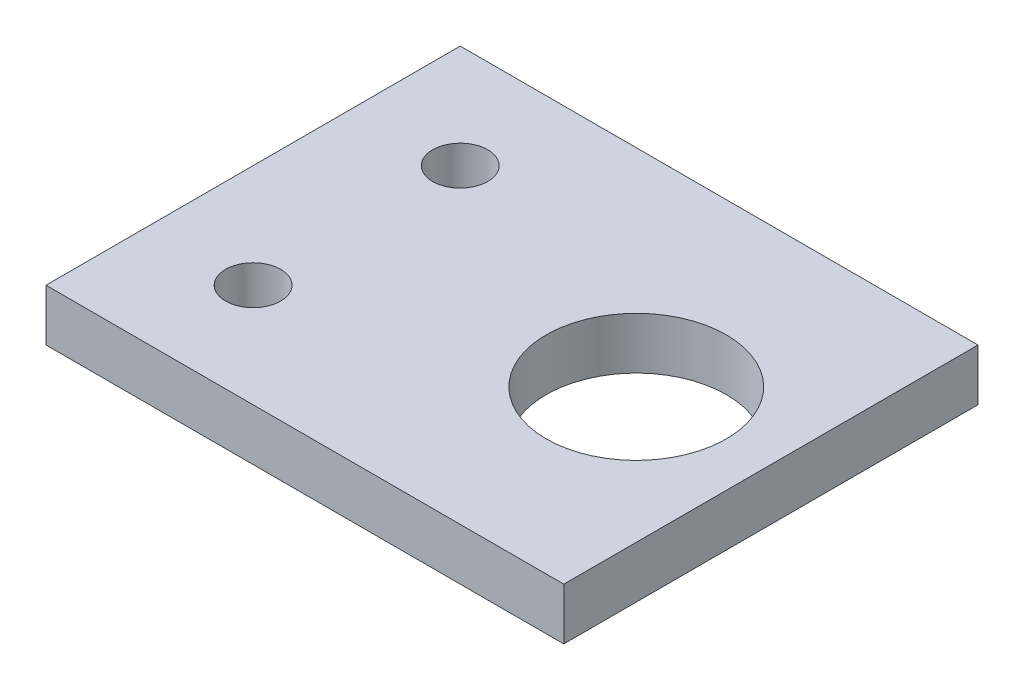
from build123d import *

# Parameters (mm, degrees)
SKETCH1_W                = 63.5
SKETCH1_H                = 50.8
BOSS_EXTRUDE1_DEPTH      = 6.35
H_0_266_DIAMETER_HOLE1_D = 6.7564
SKETCH4_R                = 11.049
CUT_EXTRUDE1_DEPTH       = 42.152703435


with BuildPart() as part:
    # Sketch1 → Boss-Extrude1 (new body)
    with BuildSketch(Plane(origin=(0, 0, 0), x_dir=(1, 0, 0), z_dir=(0, 1, 0))):
        Rectangle(SKETCH1_W, SKETCH1_H)
    extrude(amount=BOSS_EXTRUDE1_DEPTH)

    # H _0.266_ Diameter Hole1 (through all)
    with Locations(Plane(origin=(0, 6.35, 0), x_dir=(1, 0, 0), z_dir=(0, 1, 0))):
        with Locations((-19.05, -12.7), (-19.05, 12.7)):
            Hole(H_0_266_DIAMETER_HOLE1_D / 2)

    # Sketch4 → Cut-Extrude1 (cut, through all)
    with BuildSketch(Plane(origin=(0, 6.35, 0), x_dir=(1, 0, 0), z_dir=(0, 1, 0))):
        with Locations(Location((15.24, 0, 0), (0, 0, 270))):
            Circle(SKETCH4_R)
    extrude(amount=-CUT_EXTRUDE1_DEPTH, mode=Mode.SUBTRACT)


solid = part.part
